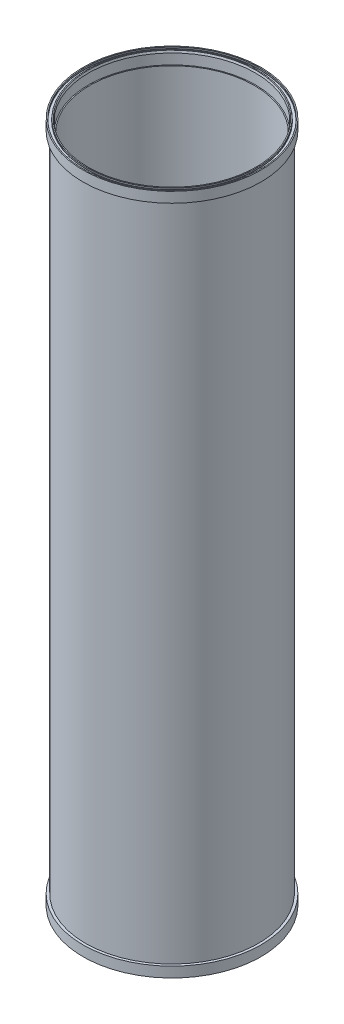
ISO-10303-21;
HEADER;
FILE_DESCRIPTION(('STEP AP214'),'2;1');
FILE_NAME('part.step','',(''),(''),'','','');
FILE_SCHEMA(('AUTOMOTIVE_DESIGN { 1 0 10303 214 1 1 1 1 }'));
ENDSEC;
DATA;
#1=APPLICATION_CONTEXT('core data for automotive mechanical design processes');
#2=APPLICATION_PROTOCOL_DEFINITION('international standard','automotive_design',2000,#1);
#3=PRODUCT_CONTEXT('',#1,'mechanical');
#4=PRODUCT('Part','Part','',(#3));
#5=PRODUCT_RELATED_PRODUCT_CATEGORY('part','',(#4));
#6=PRODUCT_DEFINITION_FORMATION('','',#4);
#7=PRODUCT_DEFINITION_CONTEXT('part definition',#1,'design');
#8=PRODUCT_DEFINITION('design','',#6,#7);
#9=PRODUCT_DEFINITION_SHAPE('','',#8);
#10=(LENGTH_UNIT() NAMED_UNIT(*) SI_UNIT(.MILLI.,.METRE.));
#11=(NAMED_UNIT(*) PLANE_ANGLE_UNIT() SI_UNIT($,.RADIAN.));
#12=(NAMED_UNIT(*) SI_UNIT($,.STERADIAN.) SOLID_ANGLE_UNIT());
#13=UNCERTAINTY_MEASURE_WITH_UNIT(LENGTH_MEASURE(1.E-05),#10,'distance_accuracy_value','');
#14=(GEOMETRIC_REPRESENTATION_CONTEXT(3) GLOBAL_UNCERTAINTY_ASSIGNED_CONTEXT((#13)) GLOBAL_UNIT_ASSIGNED_CONTEXT((#10,
#11,#12)) REPRESENTATION_CONTEXT('',''));
#15=CARTESIAN_POINT('',(0.,0.,0.));
#16=DIRECTION('',(0.,0.,1.));
#17=DIRECTION('',(1.,0.,0.));
#18=AXIS2_PLACEMENT_3D('',#15,#16,#17);
#19=CARTESIAN_POINT('',(-109.537499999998,0.,0.));
#20=DIRECTION('',(0.,1.,0.));
#21=DIRECTION('',(0.,0.,1.));
#22=AXIS2_PLACEMENT_3D('',#19,#20,#21);
#23=PLANE('',#22);
#24=CARTESIAN_POINT('',(0.,0.,0.));
#25=DIRECTION('',(0.,-1.,0.));
#26=DIRECTION('',(0.,0.,-1.));
#27=AXIS2_PLACEMENT_3D('',#24,#25,#26);
#28=CIRCLE('',#27,103.309290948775);
#29=CARTESIAN_POINT('',(0.,0.,-103.309290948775));
#30=VERTEX_POINT('',#29);
#31=EDGE_CURVE('E11',#30,#30,#28,.T.);
#32=ORIENTED_EDGE('',*,*,#31,.F.);
#33=EDGE_LOOP('',(#32));
#34=FACE_BOUND('',#33,.T.);
#35=CARTESIAN_POINT('',(0.,-3.33066907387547E-13,0.));
#36=DIRECTION('',(0.,-1.,0.));
#37=DIRECTION('',(0.,0.,-1.));
#38=AXIS2_PLACEMENT_3D('',#35,#36,#37);
#39=CIRCLE('',#38,104.4829);
#40=CARTESIAN_POINT('',(0.,-3.33066907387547E-13,-104.4829));
#41=VERTEX_POINT('',#40);
#42=EDGE_CURVE('E112',#41,#41,#39,.T.);
#43=ORIENTED_EDGE('',*,*,#42,.T.);
#44=EDGE_LOOP('',(#43));
#45=FACE_BOUND('',#44,.T.);
#46=ADVANCED_FACE('F38',(#34,#45),#23,.F.);
#47=CARTESIAN_POINT('',(-109.537499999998,838.2,0.));
#48=DIRECTION('',(0.,-1.,0.));
#49=DIRECTION('',(0.,0.,-1.));
#50=AXIS2_PLACEMENT_3D('',#47,#48,#49);
#51=PLANE('',#50);
#52=CARTESIAN_POINT('',(0.,838.2,0.));
#53=DIRECTION('',(0.,-1.,0.));
#54=DIRECTION('',(0.,0.,-1.));
#55=AXIS2_PLACEMENT_3D('',#52,#53,#54);
#56=CIRCLE('',#55,103.309290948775);
#57=CARTESIAN_POINT('',(0.,838.2,-103.309290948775));
#58=VERTEX_POINT('',#57);
#59=EDGE_CURVE('E53',#58,#58,#56,.T.);
#60=ORIENTED_EDGE('',*,*,#59,.T.);
#61=EDGE_LOOP('',(#60));
#62=FACE_BOUND('',#61,.T.);
#63=CARTESIAN_POINT('',(0.,838.2,0.));
#64=DIRECTION('',(0.,-1.,0.));
#65=DIRECTION('',(0.,0.,-1.));
#66=AXIS2_PLACEMENT_3D('',#63,#64,#65);
#67=CIRCLE('',#66,104.4829);
#68=CARTESIAN_POINT('',(0.,838.2,-104.4829));
#69=VERTEX_POINT('',#68);
#70=EDGE_CURVE('E88',#69,#69,#67,.T.);
#71=ORIENTED_EDGE('',*,*,#70,.F.);
#72=EDGE_LOOP('',(#71));
#73=FACE_BOUND('',#72,.T.);
#74=ADVANCED_FACE('F188',(#62,#73),#51,.F.);
#75=CARTESIAN_POINT('',(0.,0.,0.));
#76=DIRECTION('',(0.,-1.,0.));
#77=DIRECTION('',(0.,0.,-1.));
#78=AXIS2_PLACEMENT_3D('',#75,#76,#77);
#79=CYLINDRICAL_SURFACE('',#78,109.537499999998);
#80=CARTESIAN_POINT('',(0.,12.7,0.));
#81=DIRECTION('',(0.,1.,0.));
#82=DIRECTION('',(0.,0.,1.));
#83=AXIS2_PLACEMENT_3D('',#80,#81,#82);
#84=CIRCLE('',#83,109.537499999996);
#85=CARTESIAN_POINT('',(0.,12.7,109.537499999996));
#86=VERTEX_POINT('',#85);
#87=EDGE_CURVE('E76',#86,#86,#84,.T.);
#88=ORIENTED_EDGE('',*,*,#87,.F.);
#89=EDGE_LOOP('',(#88));
#90=FACE_BOUND('',#89,.T.);
#91=CARTESIAN_POINT('',(0.,0.,0.));
#92=DIRECTION('',(0.,-1.,0.));
#93=DIRECTION('',(0.,0.,-1.));
#94=AXIS2_PLACEMENT_3D('',#91,#92,#93);
#95=CIRCLE('',#94,109.537499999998);
#96=CARTESIAN_POINT('',(0.,0.,-109.537499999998));
#97=VERTEX_POINT('',#96);
#98=EDGE_CURVE('E45',#97,#97,#95,.T.);
#99=ORIENTED_EDGE('',*,*,#98,.F.);
#100=EDGE_LOOP('',(#99));
#101=FACE_BOUND('',#100,.T.);
#102=ADVANCED_FACE('F185',(#90,#101),#79,.T.);
#103=CARTESIAN_POINT('',(0.,0.,0.));
#104=DIRECTION('',(0.,-1.,0.));
#105=DIRECTION('',(0.,0.,-1.));
#106=AXIS2_PLACEMENT_3D('',#103,#104,#105);
#107=CONICAL_SURFACE('',#106,103.309290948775,0.26179938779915);
#108=CARTESIAN_POINT('',(0.,2.54,0.));
#109=DIRECTION('',(0.,-1.,0.));
#110=DIRECTION('',(0.,0.,-1.));
#111=AXIS2_PLACEMENT_3D('',#108,#109,#110);
#112=CIRCLE('',#111,102.6287);
#113=CARTESIAN_POINT('',(0.,2.54,-102.6287));
#114=VERTEX_POINT('',#113);
#115=EDGE_CURVE('E73',#114,#114,#112,.T.);
#116=ORIENTED_EDGE('',*,*,#115,.F.);
#117=EDGE_LOOP('',(#116));
#118=FACE_BOUND('',#117,.T.);
#119=ORIENTED_EDGE('',*,*,#31,.T.);
#120=EDGE_LOOP('',(#119));
#121=FACE_BOUND('',#120,.T.);
#122=ADVANCED_FACE('F40',(#118,#121),#107,.F.);
#123=CARTESIAN_POINT('',(0.,-3.33066907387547E-13,0.));
#124=DIRECTION('',(0.,-1.,0.));
#125=DIRECTION('',(0.,0.,-1.));
#126=AXIS2_PLACEMENT_3D('',#123,#124,#125);
#127=CIRCLE('',#126,108.2675);
#128=CARTESIAN_POINT('',(0.,-3.33066907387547E-13,-108.2675));
#129=VERTEX_POINT('',#128);
#130=EDGE_CURVE('E115',#129,#129,#127,.T.);
#131=ORIENTED_EDGE('',*,*,#130,.F.);
#132=EDGE_LOOP('',(#131));
#133=FACE_BOUND('',#132,.T.);
#134=ORIENTED_EDGE('',*,*,#98,.T.);
#135=EDGE_LOOP('',(#134));
#136=FACE_BOUND('',#135,.T.);
#137=ADVANCED_FACE('F175',(#133,#136),#23,.F.);
#138=CARTESIAN_POINT('',(0.,825.5,0.));
#139=DIRECTION('',(0.,1.,0.));
#140=DIRECTION('',(0.,0.,1.));
#141=AXIS2_PLACEMENT_3D('',#138,#139,#140);
#142=CIRCLE('',#141,109.537499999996);
#143=CARTESIAN_POINT('',(0.,825.5,109.537499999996));
#144=VERTEX_POINT('',#143);
#145=EDGE_CURVE('E84',#144,#144,#142,.T.);
#146=ORIENTED_EDGE('',*,*,#145,.T.);
#147=EDGE_LOOP('',(#146));
#148=FACE_BOUND('',#147,.T.);
#149=CARTESIAN_POINT('',(0.,838.2,0.));
#150=DIRECTION('',(0.,-1.,0.));
#151=DIRECTION('',(0.,0.,-1.));
#152=AXIS2_PLACEMENT_3D('',#149,#150,#151);
#153=CIRCLE('',#152,109.537499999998);
#154=CARTESIAN_POINT('',(0.,838.2,-109.537499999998));
#155=VERTEX_POINT('',#154);
#156=EDGE_CURVE('E49',#155,#155,#153,.T.);
#157=ORIENTED_EDGE('',*,*,#156,.T.);
#158=EDGE_LOOP('',(#157));
#159=FACE_BOUND('',#158,.T.);
#160=ADVANCED_FACE('F177',(#148,#159),#79,.T.);
#161=CARTESIAN_POINT('',(0.,838.2,0.));
#162=DIRECTION('',(0.,-1.,0.));
#163=DIRECTION('',(0.,0.,-1.));
#164=AXIS2_PLACEMENT_3D('',#161,#162,#163);
#165=CIRCLE('',#164,108.2675);
#166=CARTESIAN_POINT('',(0.,838.2,-108.2675));
#167=VERTEX_POINT('',#166);
#168=EDGE_CURVE('E91',#167,#167,#165,.T.);
#169=ORIENTED_EDGE('',*,*,#168,.T.);
#170=EDGE_LOOP('',(#169));
#171=FACE_BOUND('',#170,.T.);
#172=ORIENTED_EDGE('',*,*,#156,.F.);
#173=EDGE_LOOP('',(#172));
#174=FACE_BOUND('',#173,.T.);
#175=ADVANCED_FACE('F182',(#171,#174),#51,.F.);
#176=CARTESIAN_POINT('',(0.,835.66,0.));
#177=DIRECTION('',(0.,1.,0.));
#178=DIRECTION('',(0.,0.,1.));
#179=AXIS2_PLACEMENT_3D('',#176,#177,#178);
#180=CONICAL_SURFACE('',#179,102.6287,0.261799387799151);
#181=ORIENTED_EDGE('',*,*,#59,.F.);
#182=EDGE_LOOP('',(#181));
#183=FACE_BOUND('',#182,.T.);
#184=CARTESIAN_POINT('',(0.,835.66,0.));
#185=DIRECTION('',(0.,-1.,0.));
#186=DIRECTION('',(0.,0.,-1.));
#187=AXIS2_PLACEMENT_3D('',#184,#185,#186);
#188=CIRCLE('',#187,102.6287);
#189=CARTESIAN_POINT('',(0.,835.66,-102.6287));
#190=VERTEX_POINT('',#189);
#191=EDGE_CURVE('E58',#190,#190,#188,.T.);
#192=ORIENTED_EDGE('',*,*,#191,.T.);
#193=EDGE_LOOP('',(#192));
#194=FACE_BOUND('',#193,.T.);
#195=ADVANCED_FACE('F262',(#183,#194),#180,.F.);
#196=CARTESIAN_POINT('',(0.,0.,0.));
#197=DIRECTION('',(0.,-1.,0.));
#198=DIRECTION('',(0.,0.,-1.));
#199=AXIS2_PLACEMENT_3D('',#196,#197,#198);
#200=CYLINDRICAL_SURFACE('',#199,102.6287);
#201=ORIENTED_EDGE('',*,*,#191,.F.);
#202=EDGE_LOOP('',(#201));
#203=FACE_BOUND('',#202,.T.);
#204=CARTESIAN_POINT('',(0.,822.96,0.));
#205=DIRECTION('',(0.,-1.,0.));
#206=DIRECTION('',(0.,0.,-1.));
#207=AXIS2_PLACEMENT_3D('',#204,#205,#206);
#208=CIRCLE('',#207,102.6287);
#209=CARTESIAN_POINT('',(0.,822.96,-102.6287));
#210=VERTEX_POINT('',#209);
#211=EDGE_CURVE('E61',#210,#210,#208,.T.);
#212=ORIENTED_EDGE('',*,*,#211,.T.);
#213=EDGE_LOOP('',(#212));
#214=FACE_BOUND('',#213,.T.);
#215=ADVANCED_FACE('F258',(#203,#214),#200,.F.);
#216=CARTESIAN_POINT('',(-102.6287,822.96,0.));
#217=DIRECTION('',(0.,-1.,0.));
#218=DIRECTION('',(0.,0.,-1.));
#219=AXIS2_PLACEMENT_3D('',#216,#217,#218);
#220=PLANE('',#219);
#221=ORIENTED_EDGE('',*,*,#211,.F.);
#222=EDGE_LOOP('',(#221));
#223=FACE_BOUND('',#222,.T.);
#224=CARTESIAN_POINT('',(0.,822.96,0.));
#225=DIRECTION('',(0.,-1.,0.));
#226=DIRECTION('',(0.,0.,-1.));
#227=AXIS2_PLACEMENT_3D('',#224,#225,#226);
#228=CIRCLE('',#227,101.3587);
#229=CARTESIAN_POINT('',(0.,822.96,-101.3587));
#230=VERTEX_POINT('',#229);
#231=EDGE_CURVE('E64',#230,#230,#228,.T.);
#232=ORIENTED_EDGE('',*,*,#231,.T.);
#233=EDGE_LOOP('',(#232));
#234=FACE_BOUND('',#233,.T.);
#235=ADVANCED_FACE('F254',(#223,#234),#220,.F.);
#236=CARTESIAN_POINT('',(0.,0.,0.));
#237=DIRECTION('',(0.,-1.,0.));
#238=DIRECTION('',(0.,0.,-1.));
#239=AXIS2_PLACEMENT_3D('',#236,#237,#238);
#240=CYLINDRICAL_SURFACE('',#239,101.3587);
#241=ORIENTED_EDGE('',*,*,#231,.F.);
#242=EDGE_LOOP('',(#241));
#243=FACE_BOUND('',#242,.T.);
#244=CARTESIAN_POINT('',(0.,15.24,0.));
#245=DIRECTION('',(0.,-1.,0.));
#246=DIRECTION('',(0.,0.,-1.));
#247=AXIS2_PLACEMENT_3D('',#244,#245,#246);
#248=CIRCLE('',#247,101.3587);
#249=CARTESIAN_POINT('',(0.,15.24,-101.3587));
#250=VERTEX_POINT('',#249);
#251=EDGE_CURVE('E67',#250,#250,#248,.T.);
#252=ORIENTED_EDGE('',*,*,#251,.T.);
#253=EDGE_LOOP('',(#252));
#254=FACE_BOUND('',#253,.T.);
#255=ADVANCED_FACE('F250',(#243,#254),#240,.F.);
#256=CARTESIAN_POINT('',(-102.6287,15.24,0.));
#257=DIRECTION('',(0.,1.,0.));
#258=DIRECTION('',(0.,0.,1.));
#259=AXIS2_PLACEMENT_3D('',#256,#257,#258);
#260=PLANE('',#259);
#261=ORIENTED_EDGE('',*,*,#251,.F.);
#262=EDGE_LOOP('',(#261));
#263=FACE_BOUND('',#262,.T.);
#264=CARTESIAN_POINT('',(0.,15.24,0.));
#265=DIRECTION('',(0.,-1.,0.));
#266=DIRECTION('',(0.,0.,-1.));
#267=AXIS2_PLACEMENT_3D('',#264,#265,#266);
#268=CIRCLE('',#267,102.6287);
#269=CARTESIAN_POINT('',(0.,15.24,-102.6287));
#270=VERTEX_POINT('',#269);
#271=EDGE_CURVE('E70',#270,#270,#268,.T.);
#272=ORIENTED_EDGE('',*,*,#271,.T.);
#273=EDGE_LOOP('',(#272));
#274=FACE_BOUND('',#273,.T.);
#275=ADVANCED_FACE('F246',(#263,#274),#260,.F.);
#276=CARTESIAN_POINT('',(0.,0.,0.));
#277=DIRECTION('',(0.,-1.,0.));
#278=DIRECTION('',(0.,0.,-1.));
#279=AXIS2_PLACEMENT_3D('',#276,#277,#278);
#280=CYLINDRICAL_SURFACE('',#279,102.6287);
#281=ORIENTED_EDGE('',*,*,#271,.F.);
#282=EDGE_LOOP('',(#281));
#283=FACE_BOUND('',#282,.T.);
#284=ORIENTED_EDGE('',*,*,#115,.T.);
#285=EDGE_LOOP('',(#284));
#286=FACE_BOUND('',#285,.T.);
#287=ADVANCED_FACE('F242',(#283,#286),#280,.F.);
#288=CARTESIAN_POINT('',(-109.537499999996,12.7,0.));
#289=DIRECTION('',(0.,-1.,0.));
#290=DIRECTION('',(0.,0.,-1.));
#291=AXIS2_PLACEMENT_3D('',#288,#289,#290);
#292=PLANE('',#291);
#293=CARTESIAN_POINT('',(0.,12.7,0.));
#294=DIRECTION('',(0.,1.,0.));
#295=DIRECTION('',(0.,0.,1.));
#296=AXIS2_PLACEMENT_3D('',#293,#294,#295);
#297=CIRCLE('',#296,106.4387);
#298=CARTESIAN_POINT('',(0.,12.7,106.4387));
#299=VERTEX_POINT('',#298);
#300=EDGE_CURVE('E79',#299,#299,#297,.T.);
#301=ORIENTED_EDGE('',*,*,#300,.F.);
#302=EDGE_LOOP('',(#301));
#303=FACE_BOUND('',#302,.T.);
#304=ORIENTED_EDGE('',*,*,#87,.T.);
#305=EDGE_LOOP('',(#304));
#306=FACE_BOUND('',#305,.T.);
#307=ADVANCED_FACE('F238',(#303,#306),#292,.F.);
#308=CARTESIAN_POINT('',(0.,880.11,0.));
#309=DIRECTION('',(0.,1.,0.));
#310=DIRECTION('',(0.,0.,1.));
#311=AXIS2_PLACEMENT_3D('',#308,#309,#310);
#312=CYLINDRICAL_SURFACE('',#311,106.4387);
#313=CARTESIAN_POINT('',(0.,825.5,0.));
#314=DIRECTION('',(0.,1.,0.));
#315=DIRECTION('',(0.,0.,1.));
#316=AXIS2_PLACEMENT_3D('',#313,#314,#315);
#317=CIRCLE('',#316,106.4387);
#318=CARTESIAN_POINT('',(0.,825.5,106.4387));
#319=VERTEX_POINT('',#318);
#320=EDGE_CURVE('E82',#319,#319,#317,.T.);
#321=ORIENTED_EDGE('',*,*,#320,.F.);
#322=EDGE_LOOP('',(#321));
#323=FACE_BOUND('',#322,.T.);
#324=ORIENTED_EDGE('',*,*,#300,.T.);
#325=EDGE_LOOP('',(#324));
#326=FACE_BOUND('',#325,.T.);
#327=ADVANCED_FACE('F234',(#323,#326),#312,.T.);
#328=CARTESIAN_POINT('',(-109.537499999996,825.5,0.));
#329=DIRECTION('',(0.,1.,0.));
#330=DIRECTION('',(0.,0.,1.));
#331=AXIS2_PLACEMENT_3D('',#328,#329,#330);
#332=PLANE('',#331);
#333=ORIENTED_EDGE('',*,*,#145,.F.);
#334=EDGE_LOOP('',(#333));
#335=FACE_BOUND('',#334,.T.);
#336=ORIENTED_EDGE('',*,*,#320,.T.);
#337=EDGE_LOOP('',(#336));
#338=FACE_BOUND('',#337,.T.);
#339=ADVANCED_FACE('F230',(#335,#338),#332,.F.);
#340=CARTESIAN_POINT('',(0.,838.073,0.));
#341=DIRECTION('',(0.,-1.,0.));
#342=DIRECTION('',(0.,0.,-1.));
#343=AXIS2_PLACEMENT_3D('',#340,#341,#342);
#344=TOROIDAL_SURFACE('',#343,104.4829,0.127000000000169);
#345=ORIENTED_EDGE('',*,*,#70,.T.);
#346=EDGE_LOOP('',(#345));
#347=FACE_BOUND('',#346,.T.);
#348=CARTESIAN_POINT('',(0.,838.073,0.));
#349=DIRECTION('',(0.,-1.,0.));
#350=DIRECTION('',(0.,0.,-1.));
#351=AXIS2_PLACEMENT_3D('',#348,#349,#350);
#352=CIRCLE('',#351,104.6099);
#353=CARTESIAN_POINT('',(0.,838.073,-104.6099));
#354=VERTEX_POINT('',#353);
#355=EDGE_CURVE('E109',#354,#354,#352,.T.);
#356=ORIENTED_EDGE('',*,*,#355,.F.);
#357=EDGE_LOOP('',(#356));
#358=FACE_BOUND('',#357,.T.);
#359=ADVANCED_FACE('F226',(#347,#358),#344,.T.);
#360=CARTESIAN_POINT('',(0.,838.073,0.));
#361=DIRECTION('',(0.,-1.,0.));
#362=DIRECTION('',(0.,0.,-1.));
#363=AXIS2_PLACEMENT_3D('',#360,#361,#362);
#364=TOROIDAL_SURFACE('',#363,108.2675,0.127000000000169);
#365=CARTESIAN_POINT('',(0.,838.073,0.));
#366=DIRECTION('',(0.,-1.,0.));
#367=DIRECTION('',(0.,0.,-1.));
#368=AXIS2_PLACEMENT_3D('',#365,#366,#367);
#369=CIRCLE('',#368,108.1405);
#370=CARTESIAN_POINT('',(0.,838.073,-108.1405));
#371=VERTEX_POINT('',#370);
#372=EDGE_CURVE('E94',#371,#371,#369,.T.);
#373=ORIENTED_EDGE('',*,*,#372,.T.);
#374=EDGE_LOOP('',(#373));
#375=FACE_BOUND('',#374,.T.);
#376=ORIENTED_EDGE('',*,*,#168,.F.);
#377=EDGE_LOOP('',(#376));
#378=FACE_BOUND('',#377,.T.);
#379=ADVANCED_FACE('F222',(#375,#378),#364,.T.);
#380=CARTESIAN_POINT('',(0.,0.,0.));
#381=DIRECTION('',(0.,-1.,0.));
#382=DIRECTION('',(0.,0.,-1.));
#383=AXIS2_PLACEMENT_3D('',#380,#381,#382);
#384=CYLINDRICAL_SURFACE('',#383,108.1405);
#385=CARTESIAN_POINT('',(0.,836.4982,0.));
#386=DIRECTION('',(0.,-1.,0.));
#387=DIRECTION('',(0.,0.,-1.));
#388=AXIS2_PLACEMENT_3D('',#385,#386,#387);
#389=CIRCLE('',#388,108.1405);
#390=CARTESIAN_POINT('',(0.,836.4982,-108.1405));
#391=VERTEX_POINT('',#390);
#392=EDGE_CURVE('E97',#391,#391,#389,.T.);
#393=ORIENTED_EDGE('',*,*,#392,.T.);
#394=EDGE_LOOP('',(#393));
#395=FACE_BOUND('',#394,.T.);
#396=ORIENTED_EDGE('',*,*,#372,.F.);
#397=EDGE_LOOP('',(#396));
#398=FACE_BOUND('',#397,.T.);
#399=ADVANCED_FACE('F218',(#395,#398),#384,.F.);
#400=CARTESIAN_POINT('',(0.,836.4982,0.));
#401=DIRECTION('',(0.,-1.,0.));
#402=DIRECTION('',(0.,0.,-1.));
#403=AXIS2_PLACEMENT_3D('',#400,#401,#402);
#404=TOROIDAL_SURFACE('',#403,107.8865,0.25399999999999);
#405=CARTESIAN_POINT('',(0.,836.2442,0.));
#406=DIRECTION('',(0.,-1.,0.));
#407=DIRECTION('',(0.,0.,-1.));
#408=AXIS2_PLACEMENT_3D('',#405,#406,#407);
#409=CIRCLE('',#408,107.8865);
#410=CARTESIAN_POINT('',(0.,836.2442,-107.8865));
#411=VERTEX_POINT('',#410);
#412=EDGE_CURVE('E100',#411,#411,#409,.T.);
#413=ORIENTED_EDGE('',*,*,#412,.T.);
#414=EDGE_LOOP('',(#413));
#415=FACE_BOUND('',#414,.T.);
#416=ORIENTED_EDGE('',*,*,#392,.F.);
#417=EDGE_LOOP('',(#416));
#418=FACE_BOUND('',#417,.T.);
#419=ADVANCED_FACE('F214',(#415,#418),#404,.F.);
#420=CARTESIAN_POINT('',(-104.8639,836.2442,0.));
#421=DIRECTION('',(0.,1.,0.));
#422=DIRECTION('',(0.,0.,1.));
#423=AXIS2_PLACEMENT_3D('',#420,#421,#422);
#424=PLANE('',#423);
#425=CARTESIAN_POINT('',(0.,836.2442,0.));
#426=DIRECTION('',(0.,-1.,0.));
#427=DIRECTION('',(0.,0.,-1.));
#428=AXIS2_PLACEMENT_3D('',#425,#426,#427);
#429=CIRCLE('',#428,104.8639);
#430=CARTESIAN_POINT('',(0.,836.2442,-104.8639));
#431=VERTEX_POINT('',#430);
#432=EDGE_CURVE('E103',#431,#431,#429,.T.);
#433=ORIENTED_EDGE('',*,*,#432,.T.);
#434=EDGE_LOOP('',(#433));
#435=FACE_BOUND('',#434,.T.);
#436=ORIENTED_EDGE('',*,*,#412,.F.);
#437=EDGE_LOOP('',(#436));
#438=FACE_BOUND('',#437,.T.);
#439=ADVANCED_FACE('F210',(#435,#438),#424,.T.);
#440=CARTESIAN_POINT('',(0.,836.4982,0.));
#441=DIRECTION('',(0.,-1.,0.));
#442=DIRECTION('',(0.,0.,-1.));
#443=AXIS2_PLACEMENT_3D('',#440,#441,#442);
#444=TOROIDAL_SURFACE('',#443,104.8639,0.25399999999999);
#445=CARTESIAN_POINT('',(0.,836.4982,0.));
#446=DIRECTION('',(0.,-1.,0.));
#447=DIRECTION('',(0.,0.,-1.));
#448=AXIS2_PLACEMENT_3D('',#445,#446,#447);
#449=CIRCLE('',#448,104.6099);
#450=CARTESIAN_POINT('',(0.,836.4982,-104.6099));
#451=VERTEX_POINT('',#450);
#452=EDGE_CURVE('E106',#451,#451,#449,.T.);
#453=ORIENTED_EDGE('',*,*,#452,.T.);
#454=EDGE_LOOP('',(#453));
#455=FACE_BOUND('',#454,.T.);
#456=ORIENTED_EDGE('',*,*,#432,.F.);
#457=EDGE_LOOP('',(#456));
#458=FACE_BOUND('',#457,.T.);
#459=ADVANCED_FACE('F204',(#455,#458),#444,.F.);
#460=CARTESIAN_POINT('',(0.,0.,0.));
#461=DIRECTION('',(0.,-1.,0.));
#462=DIRECTION('',(0.,0.,-1.));
#463=AXIS2_PLACEMENT_3D('',#460,#461,#462);
#464=CYLINDRICAL_SURFACE('',#463,104.6099);
#465=ORIENTED_EDGE('',*,*,#355,.T.);
#466=EDGE_LOOP('',(#465));
#467=FACE_BOUND('',#466,.T.);
#468=ORIENTED_EDGE('',*,*,#452,.F.);
#469=EDGE_LOOP('',(#468));
#470=FACE_BOUND('',#469,.T.);
#471=ADVANCED_FACE('F199',(#467,#470),#464,.T.);
#472=CARTESIAN_POINT('',(0.,0.126999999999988,0.));
#473=DIRECTION('',(0.,1.,0.));
#474=DIRECTION('',(0.,0.,-1.));
#475=AXIS2_PLACEMENT_3D('',#472,#473,#474);
#476=TOROIDAL_SURFACE('',#475,104.4829,0.127000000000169);
#477=ORIENTED_EDGE('',*,*,#42,.F.);
#478=EDGE_LOOP('',(#477));
#479=FACE_BOUND('',#478,.T.);
#480=CARTESIAN_POINT('',(0.,0.126999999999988,0.));
#481=DIRECTION('',(0.,-1.,0.));
#482=DIRECTION('',(0.,0.,-1.));
#483=AXIS2_PLACEMENT_3D('',#480,#481,#482);
#484=CIRCLE('',#483,104.6099);
#485=CARTESIAN_POINT('',(0.,0.126999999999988,-104.6099));
#486=VERTEX_POINT('',#485);
#487=EDGE_CURVE('E133',#486,#486,#484,.T.);
#488=ORIENTED_EDGE('',*,*,#487,.T.);
#489=EDGE_LOOP('',(#488));
#490=FACE_BOUND('',#489,.T.);
#491=ADVANCED_FACE('F137',(#479,#490),#476,.T.);
#492=CARTESIAN_POINT('',(0.,0.126999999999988,0.));
#493=DIRECTION('',(0.,1.,0.));
#494=DIRECTION('',(0.,0.,-1.));
#495=AXIS2_PLACEMENT_3D('',#492,#493,#494);
#496=TOROIDAL_SURFACE('',#495,108.2675,0.127000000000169);
#497=CARTESIAN_POINT('',(0.,0.126999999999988,0.));
#498=DIRECTION('',(0.,-1.,0.));
#499=DIRECTION('',(0.,0.,-1.));
#500=AXIS2_PLACEMENT_3D('',#497,#498,#499);
#501=CIRCLE('',#500,108.1405);
#502=CARTESIAN_POINT('',(0.,0.126999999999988,-108.1405));
#503=VERTEX_POINT('',#502);
#504=EDGE_CURVE('E118',#503,#503,#501,.T.);
#505=ORIENTED_EDGE('',*,*,#504,.F.);
#506=EDGE_LOOP('',(#505));
#507=FACE_BOUND('',#506,.T.);
#508=ORIENTED_EDGE('',*,*,#130,.T.);
#509=EDGE_LOOP('',(#508));
#510=FACE_BOUND('',#509,.T.);
#511=ADVANCED_FACE('F166',(#507,#510),#496,.T.);
#512=CARTESIAN_POINT('',(0.,838.2,0.));
#513=DIRECTION('',(0.,1.,0.));
#514=DIRECTION('',(0.,0.,-1.));
#515=AXIS2_PLACEMENT_3D('',#512,#513,#514);
#516=CYLINDRICAL_SURFACE('',#515,108.1405);
#517=CARTESIAN_POINT('',(0.,1.70179999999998,0.));
#518=DIRECTION('',(0.,-1.,0.));
#519=DIRECTION('',(0.,0.,-1.));
#520=AXIS2_PLACEMENT_3D('',#517,#518,#519);
#521=CIRCLE('',#520,108.1405);
#522=CARTESIAN_POINT('',(0.,1.70179999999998,-108.1405));
#523=VERTEX_POINT('',#522);
#524=EDGE_CURVE('E121',#523,#523,#521,.T.);
#525=ORIENTED_EDGE('',*,*,#524,.F.);
#526=EDGE_LOOP('',(#525));
#527=FACE_BOUND('',#526,.T.);
#528=ORIENTED_EDGE('',*,*,#504,.T.);
#529=EDGE_LOOP('',(#528));
#530=FACE_BOUND('',#529,.T.);
#531=ADVANCED_FACE('F160',(#527,#530),#516,.F.);
#532=CARTESIAN_POINT('',(0.,1.70179999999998,0.));
#533=DIRECTION('',(0.,1.,0.));
#534=DIRECTION('',(0.,0.,-1.));
#535=AXIS2_PLACEMENT_3D('',#532,#533,#534);
#536=TOROIDAL_SURFACE('',#535,107.8865,0.25399999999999);
#537=CARTESIAN_POINT('',(0.,1.95579999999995,0.));
#538=DIRECTION('',(0.,-1.,0.));
#539=DIRECTION('',(0.,0.,-1.));
#540=AXIS2_PLACEMENT_3D('',#537,#538,#539);
#541=CIRCLE('',#540,107.8865);
#542=CARTESIAN_POINT('',(0.,1.95579999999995,-107.8865));
#543=VERTEX_POINT('',#542);
#544=EDGE_CURVE('E124',#543,#543,#541,.T.);
#545=ORIENTED_EDGE('',*,*,#544,.F.);
#546=EDGE_LOOP('',(#545));
#547=FACE_BOUND('',#546,.T.);
#548=ORIENTED_EDGE('',*,*,#524,.T.);
#549=EDGE_LOOP('',(#548));
#550=FACE_BOUND('',#549,.T.);
#551=ADVANCED_FACE('F154',(#547,#550),#536,.F.);
#552=CARTESIAN_POINT('',(-104.8639,1.95579999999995,0.));
#553=DIRECTION('',(0.,-1.,0.));
#554=DIRECTION('',(0.,0.,1.));
#555=AXIS2_PLACEMENT_3D('',#552,#553,#554);
#556=PLANE('',#555);
#557=CARTESIAN_POINT('',(0.,1.95579999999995,0.));
#558=DIRECTION('',(0.,-1.,0.));
#559=DIRECTION('',(0.,0.,-1.));
#560=AXIS2_PLACEMENT_3D('',#557,#558,#559);
#561=CIRCLE('',#560,104.8639);
#562=CARTESIAN_POINT('',(0.,1.95579999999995,-104.8639));
#563=VERTEX_POINT('',#562);
#564=EDGE_CURVE('E127',#563,#563,#561,.T.);
#565=ORIENTED_EDGE('',*,*,#564,.F.);
#566=EDGE_LOOP('',(#565));
#567=FACE_BOUND('',#566,.T.);
#568=ORIENTED_EDGE('',*,*,#544,.T.);
#569=EDGE_LOOP('',(#568));
#570=FACE_BOUND('',#569,.T.);
#571=ADVANCED_FACE('F148',(#567,#570),#556,.T.);
#572=CARTESIAN_POINT('',(0.,1.70179999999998,0.));
#573=DIRECTION('',(0.,1.,0.));
#574=DIRECTION('',(0.,0.,-1.));
#575=AXIS2_PLACEMENT_3D('',#572,#573,#574);
#576=TOROIDAL_SURFACE('',#575,104.8639,0.25399999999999);
#577=CARTESIAN_POINT('',(0.,1.70179999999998,0.));
#578=DIRECTION('',(0.,-1.,0.));
#579=DIRECTION('',(0.,0.,-1.));
#580=AXIS2_PLACEMENT_3D('',#577,#578,#579);
#581=CIRCLE('',#580,104.6099);
#582=CARTESIAN_POINT('',(0.,1.70179999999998,-104.6099));
#583=VERTEX_POINT('',#582);
#584=EDGE_CURVE('E130',#583,#583,#581,.T.);
#585=ORIENTED_EDGE('',*,*,#584,.F.);
#586=EDGE_LOOP('',(#585));
#587=FACE_BOUND('',#586,.T.);
#588=ORIENTED_EDGE('',*,*,#564,.T.);
#589=EDGE_LOOP('',(#588));
#590=FACE_BOUND('',#589,.T.);
#591=ADVANCED_FACE('F142',(#587,#590),#576,.F.);
#592=CARTESIAN_POINT('',(0.,838.2,0.));
#593=DIRECTION('',(0.,1.,0.));
#594=DIRECTION('',(0.,0.,-1.));
#595=AXIS2_PLACEMENT_3D('',#592,#593,#594);
#596=CYLINDRICAL_SURFACE('',#595,104.6099);
#597=ORIENTED_EDGE('',*,*,#487,.F.);
#598=EDGE_LOOP('',(#597));
#599=FACE_BOUND('',#598,.T.);
#600=ORIENTED_EDGE('',*,*,#584,.T.);
#601=EDGE_LOOP('',(#600));
#602=FACE_BOUND('',#601,.T.);
#603=ADVANCED_FACE('F139',(#599,#602),#596,.T.);
#604=CLOSED_SHELL('',(#46,#74,#102,#122,#137,#160,#175,#195,#215,#235,#255,#275,#287,#307,#327,
#339,#359,#379,#399,#419,#439,#459,#471,#491,#511,#531,#551,#571,#591,#603));
#605=MANIFOLD_SOLID_BREP('B2',#604);
#606=ADVANCED_BREP_SHAPE_REPRESENTATION('',(#18,#605),#14);
#607=SHAPE_DEFINITION_REPRESENTATION(#9,#606);
ENDSEC;
END-ISO-10303-21;
